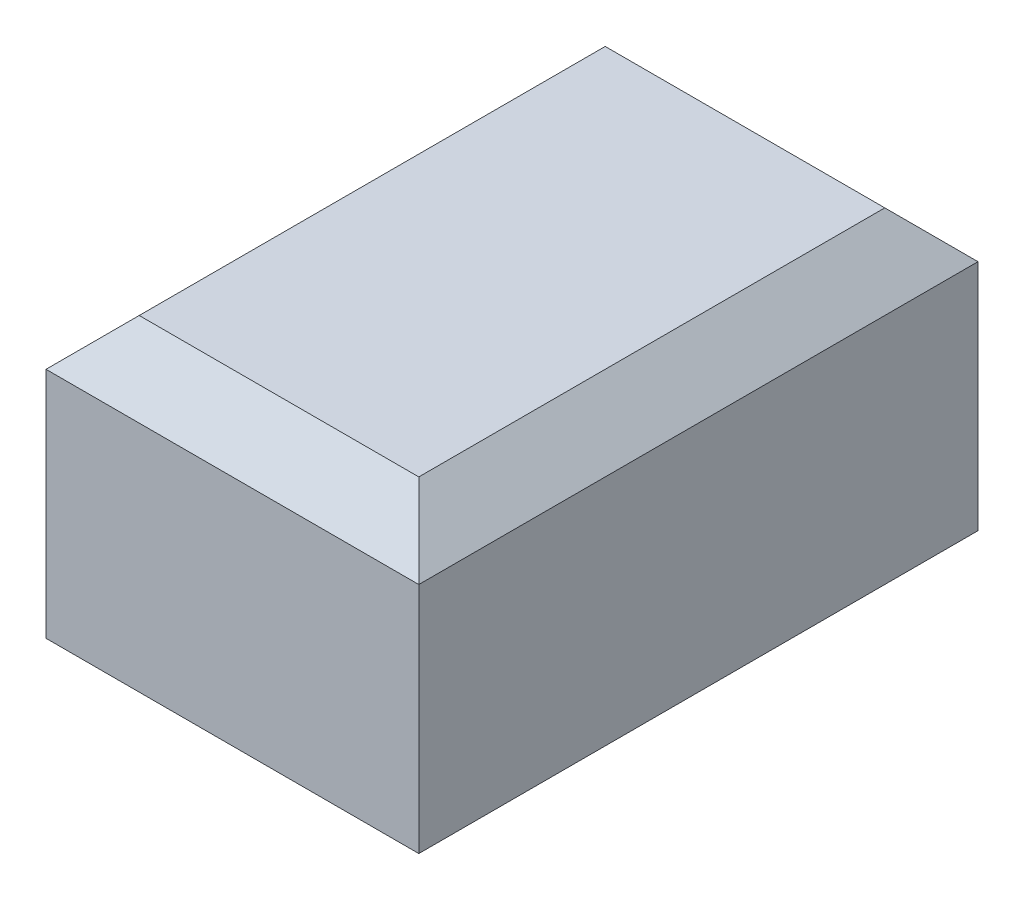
ISO-10303-21;
HEADER;
FILE_DESCRIPTION(('STEP AP214'),'2;1');
FILE_NAME('part.step','',(''),(''),'','','');
FILE_SCHEMA(('AUTOMOTIVE_DESIGN { 1 0 10303 214 1 1 1 1 }'));
ENDSEC;
DATA;
#1=APPLICATION_CONTEXT('core data for automotive mechanical design processes');
#2=APPLICATION_PROTOCOL_DEFINITION('international standard','automotive_design',2000,#1);
#3=PRODUCT_CONTEXT('',#1,'mechanical');
#4=PRODUCT('Part','Part','',(#3));
#5=PRODUCT_RELATED_PRODUCT_CATEGORY('part','',(#4));
#6=PRODUCT_DEFINITION_FORMATION('','',#4);
#7=PRODUCT_DEFINITION_CONTEXT('part definition',#1,'design');
#8=PRODUCT_DEFINITION('design','',#6,#7);
#9=PRODUCT_DEFINITION_SHAPE('','',#8);
#10=(LENGTH_UNIT() NAMED_UNIT(*) SI_UNIT(.MILLI.,.METRE.));
#11=(NAMED_UNIT(*) PLANE_ANGLE_UNIT() SI_UNIT($,.RADIAN.));
#12=(NAMED_UNIT(*) SI_UNIT($,.STERADIAN.) SOLID_ANGLE_UNIT());
#13=UNCERTAINTY_MEASURE_WITH_UNIT(LENGTH_MEASURE(1.E-05),#10,'distance_accuracy_value','');
#14=(GEOMETRIC_REPRESENTATION_CONTEXT(3) GLOBAL_UNCERTAINTY_ASSIGNED_CONTEXT((#13)) GLOBAL_UNIT_ASSIGNED_CONTEXT((#10,
#11,#12)) REPRESENTATION_CONTEXT('',''));
#15=CARTESIAN_POINT('',(0.,0.,0.));
#16=DIRECTION('',(0.,0.,1.));
#17=DIRECTION('',(1.,0.,0.));
#18=AXIS2_PLACEMENT_3D('',#15,#16,#17);
#19=CARTESIAN_POINT('',(0.,0.,12.));
#20=DIRECTION('',(1.,0.,0.));
#21=DIRECTION('',(0.,0.,-1.));
#22=AXIS2_PLACEMENT_3D('',#19,#20,#21);
#23=PLANE('',#22);
#24=DIRECTION('',(0.,-1.,0.));
#25=VECTOR('',#24,1.);
#26=CARTESIAN_POINT('',(0.,0.,12.));
#27=LINE('',#26,#25);
#28=CARTESIAN_POINT('',(0.,5.99999999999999,12.));
#29=VERTEX_POINT('',#28);
#30=CARTESIAN_POINT('',(0.,1.,12.));
#31=VERTEX_POINT('',#30);
#32=EDGE_CURVE('E439',#29,#31,#27,.T.);
#33=ORIENTED_EDGE('',*,*,#32,.F.);
#34=DIRECTION('',(0.,0.,-1.));
#35=VECTOR('',#34,1.);
#36=CARTESIAN_POINT('',(0.,6.,12.));
#37=LINE('',#36,#35);
#38=CARTESIAN_POINT('',(0.,5.99999999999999,0.));
#39=VERTEX_POINT('',#38);
#40=EDGE_CURVE('E453',#29,#39,#37,.T.);
#41=ORIENTED_EDGE('',*,*,#40,.T.);
#42=DIRECTION('',(0.,-1.,0.));
#43=VECTOR('',#42,1.);
#44=CARTESIAN_POINT('',(0.,0.,0.));
#45=LINE('',#44,#43);
#46=CARTESIAN_POINT('',(0.,1.,0.));
#47=VERTEX_POINT('',#46);
#48=EDGE_CURVE('E430',#39,#47,#45,.T.);
#49=ORIENTED_EDGE('',*,*,#48,.T.);
#50=DIRECTION('',(0.,0.,1.));
#51=VECTOR('',#50,1.);
#52=CARTESIAN_POINT('',(0.,1.,12.));
#53=LINE('',#52,#51);
#54=EDGE_CURVE('E451',#47,#31,#53,.T.);
#55=ORIENTED_EDGE('',*,*,#54,.T.);
#56=EDGE_LOOP('',(#33,#41,#49,#55));
#57=FACE_BOUND('',#56,.T.);
#58=ADVANCED_FACE('F349',(#57),#23,.F.);
#59=CARTESIAN_POINT('',(0.,0.,12.));
#60=DIRECTION('',(0.,1.,0.));
#61=DIRECTION('',(0.,0.,1.));
#62=AXIS2_PLACEMENT_3D('',#59,#60,#61);
#63=PLANE('',#62);
#64=DIRECTION('',(1.,0.,0.));
#65=VECTOR('',#64,1.);
#66=CARTESIAN_POINT('',(7.99999999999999,0.,1.));
#67=LINE('',#66,#65);
#68=CARTESIAN_POINT('',(1.,0.,1.));
#69=VERTEX_POINT('',#68);
#70=CARTESIAN_POINT('',(6.99999999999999,0.,1.));
#71=VERTEX_POINT('',#70);
#72=EDGE_CURVE('E356',#69,#71,#67,.T.);
#73=ORIENTED_EDGE('',*,*,#72,.T.);
#74=DIRECTION('',(0.,0.,1.));
#75=VECTOR('',#74,1.);
#76=CARTESIAN_POINT('',(6.99999999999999,0.,12.));
#77=LINE('',#76,#75);
#78=CARTESIAN_POINT('',(6.99999999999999,0.,11.));
#79=VERTEX_POINT('',#78);
#80=EDGE_CURVE('E11',#71,#79,#77,.T.);
#81=ORIENTED_EDGE('',*,*,#80,.T.);
#82=DIRECTION('',(-1.,0.,0.));
#83=VECTOR('',#82,1.);
#84=CARTESIAN_POINT('',(0.,0.,11.));
#85=LINE('',#84,#83);
#86=CARTESIAN_POINT('',(1.,0.,11.));
#87=VERTEX_POINT('',#86);
#88=EDGE_CURVE('E463',#79,#87,#85,.T.);
#89=ORIENTED_EDGE('',*,*,#88,.T.);
#90=DIRECTION('',(0.,0.,-1.));
#91=VECTOR('',#90,1.);
#92=CARTESIAN_POINT('',(1.,0.,12.));
#93=LINE('',#92,#91);
#94=EDGE_CURVE('E366',#87,#69,#93,.T.);
#95=ORIENTED_EDGE('',*,*,#94,.T.);
#96=EDGE_LOOP('',(#73,#81,#89,#95));
#97=FACE_BOUND('',#96,.T.);
#98=ADVANCED_FACE('F466',(#97),#63,.F.);
#99=CARTESIAN_POINT('',(7.99999999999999,0.,12.));
#100=DIRECTION('',(-1.,0.,0.));
#101=DIRECTION('',(0.,-1.,0.));
#102=AXIS2_PLACEMENT_3D('',#99,#100,#101);
#103=PLANE('',#102);
#104=DIRECTION('',(0.,1.,0.));
#105=VECTOR('',#104,1.);
#106=CARTESIAN_POINT('',(7.99999999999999,0.,0.));
#107=LINE('',#106,#105);
#108=CARTESIAN_POINT('',(7.99999999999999,1.,0.));
#109=VERTEX_POINT('',#108);
#110=CARTESIAN_POINT('',(8.,5.99999999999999,0.));
#111=VERTEX_POINT('',#110);
#112=EDGE_CURVE('E490',#109,#111,#107,.T.);
#113=ORIENTED_EDGE('',*,*,#112,.T.);
#114=DIRECTION('',(0.,0.,1.));
#115=VECTOR('',#114,1.);
#116=CARTESIAN_POINT('',(8.,5.99999999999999,12.));
#117=LINE('',#116,#115);
#118=CARTESIAN_POINT('',(8.,5.99999999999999,12.));
#119=VERTEX_POINT('',#118);
#120=EDGE_CURVE('E461',#111,#119,#117,.T.);
#121=ORIENTED_EDGE('',*,*,#120,.T.);
#122=DIRECTION('',(0.,1.,0.));
#123=VECTOR('',#122,1.);
#124=CARTESIAN_POINT('',(7.99999999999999,0.,12.));
#125=LINE('',#124,#123);
#126=CARTESIAN_POINT('',(7.99999999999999,1.,12.));
#127=VERTEX_POINT('',#126);
#128=EDGE_CURVE('E436',#127,#119,#125,.T.);
#129=ORIENTED_EDGE('',*,*,#128,.F.);
#130=DIRECTION('',(0.,0.,-1.));
#131=VECTOR('',#130,1.);
#132=CARTESIAN_POINT('',(7.99999999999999,0.999999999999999,12.));
#133=LINE('',#132,#131);
#134=EDGE_CURVE('E458',#127,#109,#133,.T.);
#135=ORIENTED_EDGE('',*,*,#134,.T.);
#136=EDGE_LOOP('',(#113,#121,#129,#135));
#137=FACE_BOUND('',#136,.T.);
#138=ADVANCED_FACE('F510',(#137),#103,.F.);
#139=CARTESIAN_POINT('',(0.,7.,12.));
#140=DIRECTION('',(0.,-1.,0.));
#141=DIRECTION('',(0.,0.,-1.));
#142=AXIS2_PLACEMENT_3D('',#139,#140,#141);
#143=PLANE('',#142);
#144=DIRECTION('',(0.,0.,-1.));
#145=VECTOR('',#144,1.);
#146=CARTESIAN_POINT('',(7.,7.,12.));
#147=LINE('',#146,#145);
#148=CARTESIAN_POINT('',(7.,7.,11.));
#149=VERTEX_POINT('',#148);
#150=CARTESIAN_POINT('',(7.,7.,0.999999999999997));
#151=VERTEX_POINT('',#150);
#152=EDGE_CURVE('E415',#149,#151,#147,.T.);
#153=ORIENTED_EDGE('',*,*,#152,.T.);
#154=DIRECTION('',(-1.,0.,0.));
#155=VECTOR('',#154,1.);
#156=CARTESIAN_POINT('',(0.,7.,0.999999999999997));
#157=LINE('',#156,#155);
#158=CARTESIAN_POINT('',(0.999999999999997,7.,0.999999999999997));
#159=VERTEX_POINT('',#158);
#160=EDGE_CURVE('E444',#151,#159,#157,.T.);
#161=ORIENTED_EDGE('',*,*,#160,.T.);
#162=DIRECTION('',(0.,0.,1.));
#163=VECTOR('',#162,1.);
#164=CARTESIAN_POINT('',(0.999999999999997,7.,12.));
#165=LINE('',#164,#163);
#166=CARTESIAN_POINT('',(0.999999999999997,7.,11.));
#167=VERTEX_POINT('',#166);
#168=EDGE_CURVE('E418',#159,#167,#165,.T.);
#169=ORIENTED_EDGE('',*,*,#168,.T.);
#170=DIRECTION('',(1.,0.,0.));
#171=VECTOR('',#170,1.);
#172=CARTESIAN_POINT('',(0.,7.,11.));
#173=LINE('',#172,#171);
#174=EDGE_CURVE('E410',#167,#149,#173,.T.);
#175=ORIENTED_EDGE('',*,*,#174,.T.);
#176=EDGE_LOOP('',(#153,#161,#169,#175));
#177=FACE_BOUND('',#176,.T.);
#178=ADVANCED_FACE('F412',(#177),#143,.F.);
#179=CARTESIAN_POINT('',(0.,7.,12.));
#180=DIRECTION('',(0.,0.,-1.));
#181=DIRECTION('',(-1.,0.,0.));
#182=AXIS2_PLACEMENT_3D('',#179,#180,#181);
#183=PLANE('',#182);
#184=ORIENTED_EDGE('',*,*,#128,.T.);
#185=DIRECTION('',(-1.,0.,0.));
#186=VECTOR('',#185,1.);
#187=CARTESIAN_POINT('',(0.,6.,12.));
#188=LINE('',#187,#186);
#189=EDGE_CURVE('E427',#119,#29,#188,.T.);
#190=ORIENTED_EDGE('',*,*,#189,.T.);
#191=ORIENTED_EDGE('',*,*,#32,.T.);
#192=DIRECTION('',(1.,0.,0.));
#193=VECTOR('',#192,1.);
#194=CARTESIAN_POINT('',(0.,1.,12.));
#195=LINE('',#194,#193);
#196=EDGE_CURVE('E455',#31,#127,#195,.T.);
#197=ORIENTED_EDGE('',*,*,#196,.T.);
#198=EDGE_LOOP('',(#184,#190,#191,#197));
#199=FACE_BOUND('',#198,.T.);
#200=ADVANCED_FACE('F495',(#199),#183,.F.);
#201=CARTESIAN_POINT('',(0.,7.,0.));
#202=DIRECTION('',(0.,0.,-1.));
#203=DIRECTION('',(-1.,0.,0.));
#204=AXIS2_PLACEMENT_3D('',#201,#202,#203);
#205=PLANE('',#204);
#206=ORIENTED_EDGE('',*,*,#48,.F.);
#207=DIRECTION('',(1.,0.,0.));
#208=VECTOR('',#207,1.);
#209=CARTESIAN_POINT('',(8.,6.,0.));
#210=LINE('',#209,#208);
#211=EDGE_CURVE('E448',#39,#111,#210,.T.);
#212=ORIENTED_EDGE('',*,*,#211,.T.);
#213=ORIENTED_EDGE('',*,*,#112,.F.);
#214=DIRECTION('',(-1.,0.,0.));
#215=VECTOR('',#214,1.);
#216=CARTESIAN_POINT('',(0.,1.,0.));
#217=LINE('',#216,#215);
#218=EDGE_CURVE('E446',#109,#47,#217,.T.);
#219=ORIENTED_EDGE('',*,*,#218,.T.);
#220=EDGE_LOOP('',(#206,#212,#213,#219));
#221=FACE_BOUND('',#220,.T.);
#222=ADVANCED_FACE('F508',(#221),#205,.T.);
#223=CARTESIAN_POINT('',(0.,6.,12.));
#224=DIRECTION('',(0.,-0.707106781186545,-0.70710678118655));
#225=DIRECTION('',(0.,0.70710678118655,-0.707106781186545));
#226=AXIS2_PLACEMENT_3D('',#223,#224,#225);
#227=PLANE('',#226);
#228=DIRECTION('',(-0.577350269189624,-0.577350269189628,0.577350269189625));
#229=VECTOR('',#228,1.);
#230=CARTESIAN_POINT('',(0.,6.,12.));
#231=LINE('',#230,#229);
#232=EDGE_CURVE('E431',#29,#167,#231,.F.);
#233=ORIENTED_EDGE('',*,*,#232,.F.);
#234=ORIENTED_EDGE('',*,*,#189,.F.);
#235=DIRECTION('',(0.577350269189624,-0.577350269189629,0.577350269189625));
#236=VECTOR('',#235,1.);
#237=CARTESIAN_POINT('',(7.33333333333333,6.66666666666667,11.3333333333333));
#238=LINE('',#237,#236);
#239=EDGE_CURVE('E425',#149,#119,#238,.T.);
#240=ORIENTED_EDGE('',*,*,#239,.F.);
#241=ORIENTED_EDGE('',*,*,#174,.F.);
#242=EDGE_LOOP('',(#233,#234,#240,#241));
#243=FACE_BOUND('',#242,.T.);
#244=ADVANCED_FACE('F426',(#243),#227,.F.);
#245=CARTESIAN_POINT('',(7.,7.,12.));
#246=DIRECTION('',(-0.707106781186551,-0.707106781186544,0.));
#247=DIRECTION('',(0.707106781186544,-0.707106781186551,0.));
#248=AXIS2_PLACEMENT_3D('',#245,#246,#247);
#249=PLANE('',#248);
#250=ORIENTED_EDGE('',*,*,#239,.T.);
#251=ORIENTED_EDGE('',*,*,#120,.F.);
#252=DIRECTION('',(0.577350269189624,-0.577350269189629,-0.577350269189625));
#253=VECTOR('',#252,1.);
#254=CARTESIAN_POINT('',(3.33333333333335,10.6666666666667,4.66666666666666));
#255=LINE('',#254,#253);
#256=EDGE_CURVE('E434',#151,#111,#255,.T.);
#257=ORIENTED_EDGE('',*,*,#256,.F.);
#258=ORIENTED_EDGE('',*,*,#152,.F.);
#259=EDGE_LOOP('',(#250,#251,#257,#258));
#260=FACE_BOUND('',#259,.T.);
#261=ADVANCED_FACE('F433',(#260),#249,.F.);
#262=CARTESIAN_POINT('',(0.,6.,12.));
#263=DIRECTION('',(0.70710678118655,-0.707106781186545,0.));
#264=DIRECTION('',(0.707106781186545,0.70710678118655,0.));
#265=AXIS2_PLACEMENT_3D('',#262,#263,#264);
#266=PLANE('',#265);
#267=ORIENTED_EDGE('',*,*,#232,.T.);
#268=ORIENTED_EDGE('',*,*,#168,.F.);
#269=DIRECTION('',(0.577350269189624,0.577350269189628,0.577350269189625));
#270=VECTOR('',#269,1.);
#271=CARTESIAN_POINT('',(3.99999999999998,10.,3.99999999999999));
#272=LINE('',#271,#270);
#273=EDGE_CURVE('E479',#39,#159,#272,.T.);
#274=ORIENTED_EDGE('',*,*,#273,.F.);
#275=ORIENTED_EDGE('',*,*,#40,.F.);
#276=EDGE_LOOP('',(#267,#268,#274,#275));
#277=FACE_BOUND('',#276,.T.);
#278=ADVANCED_FACE('F502',(#277),#266,.F.);
#279=CARTESIAN_POINT('',(0.,7.,0.999999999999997));
#280=DIRECTION('',(0.,0.707106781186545,-0.70710678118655));
#281=DIRECTION('',(0.,0.70710678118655,0.707106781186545));
#282=AXIS2_PLACEMENT_3D('',#279,#280,#281);
#283=PLANE('',#282);
#284=ORIENTED_EDGE('',*,*,#256,.T.);
#285=ORIENTED_EDGE('',*,*,#211,.F.);
#286=ORIENTED_EDGE('',*,*,#273,.T.);
#287=ORIENTED_EDGE('',*,*,#160,.F.);
#288=EDGE_LOOP('',(#284,#285,#286,#287));
#289=FACE_BOUND('',#288,.T.);
#290=ADVANCED_FACE('F505',(#289),#283,.T.);
#291=CARTESIAN_POINT('',(1.,0.,12.));
#292=DIRECTION('',(0.707106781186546,0.707106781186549,0.));
#293=DIRECTION('',(-0.707106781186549,0.707106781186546,0.));
#294=AXIS2_PLACEMENT_3D('',#291,#292,#293);
#295=PLANE('',#294);
#296=DIRECTION('',(-0.577350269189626,0.577350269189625,-0.577350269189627));
#297=VECTOR('',#296,1.);
#298=CARTESIAN_POINT('',(4.66666666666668,-3.66666666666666,4.66666666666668));
#299=LINE('',#298,#297);
#300=EDGE_CURVE('E477',#69,#47,#299,.T.);
#301=ORIENTED_EDGE('',*,*,#300,.F.);
#302=ORIENTED_EDGE('',*,*,#94,.F.);
#303=DIRECTION('',(0.577350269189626,-0.577350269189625,-0.577350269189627));
#304=VECTOR('',#303,1.);
#305=CARTESIAN_POINT('',(0.,1.,12.));
#306=LINE('',#305,#304);
#307=EDGE_CURVE('E474',#31,#87,#306,.T.);
#308=ORIENTED_EDGE('',*,*,#307,.F.);
#309=ORIENTED_EDGE('',*,*,#54,.F.);
#310=EDGE_LOOP('',(#301,#302,#308,#309));
#311=FACE_BOUND('',#310,.T.);
#312=ADVANCED_FACE('F472',(#311),#295,.F.);
#313=CARTESIAN_POINT('',(0.,1.,12.));
#314=DIRECTION('',(0.,0.707106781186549,-0.707106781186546));
#315=DIRECTION('',(0.,0.707106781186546,0.707106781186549));
#316=AXIS2_PLACEMENT_3D('',#313,#314,#315);
#317=PLANE('',#316);
#318=ORIENTED_EDGE('',*,*,#307,.T.);
#319=ORIENTED_EDGE('',*,*,#88,.F.);
#320=DIRECTION('',(0.577350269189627,0.577350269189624,0.577350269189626));
#321=VECTOR('',#320,1.);
#322=CARTESIAN_POINT('',(5.33333333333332,-1.66666666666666,9.33333333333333));
#323=LINE('',#322,#321);
#324=EDGE_CURVE('E482',#127,#79,#323,.F.);
#325=ORIENTED_EDGE('',*,*,#324,.F.);
#326=ORIENTED_EDGE('',*,*,#196,.F.);
#327=EDGE_LOOP('',(#318,#319,#325,#326));
#328=FACE_BOUND('',#327,.T.);
#329=ADVANCED_FACE('F478',(#328),#317,.F.);
#330=CARTESIAN_POINT('',(0.,0.,1.));
#331=DIRECTION('',(0.,-0.707106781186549,-0.707106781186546));
#332=DIRECTION('',(0.,0.707106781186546,-0.707106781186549));
#333=AXIS2_PLACEMENT_3D('',#330,#331,#332);
#334=PLANE('',#333);
#335=ORIENTED_EDGE('',*,*,#300,.T.);
#336=ORIENTED_EDGE('',*,*,#218,.F.);
#337=DIRECTION('',(0.577350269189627,0.577350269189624,-0.577350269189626));
#338=VECTOR('',#337,1.);
#339=CARTESIAN_POINT('',(4.66666666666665,-2.33333333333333,3.33333333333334));
#340=LINE('',#339,#338);
#341=EDGE_CURVE('E515',#71,#109,#340,.T.);
#342=ORIENTED_EDGE('',*,*,#341,.F.);
#343=ORIENTED_EDGE('',*,*,#72,.F.);
#344=EDGE_LOOP('',(#335,#336,#342,#343));
#345=FACE_BOUND('',#344,.T.);
#346=ADVANCED_FACE('F519',(#345),#334,.T.);
#347=CARTESIAN_POINT('',(7.99999999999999,1.,12.));
#348=DIRECTION('',(-0.707106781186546,0.707106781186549,0.));
#349=DIRECTION('',(-0.707106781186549,-0.707106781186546,0.));
#350=AXIS2_PLACEMENT_3D('',#347,#348,#349);
#351=PLANE('',#350);
#352=ORIENTED_EDGE('',*,*,#324,.T.);
#353=ORIENTED_EDGE('',*,*,#80,.F.);
#354=ORIENTED_EDGE('',*,*,#341,.T.);
#355=ORIENTED_EDGE('',*,*,#134,.F.);
#356=EDGE_LOOP('',(#352,#353,#354,#355));
#357=FACE_BOUND('',#356,.T.);
#358=ADVANCED_FACE('F513',(#357),#351,.F.);
#359=CLOSED_SHELL('',(#58,#98,#138,#178,#200,#222,#244,#261,#278,#290,#312,#329,#346,#358));
#360=MANIFOLD_SOLID_BREP('B2',#359);
#361=ADVANCED_BREP_SHAPE_REPRESENTATION('',(#18,#360),#14);
#362=SHAPE_DEFINITION_REPRESENTATION(#9,#361);
ENDSEC;
END-ISO-10303-21;
